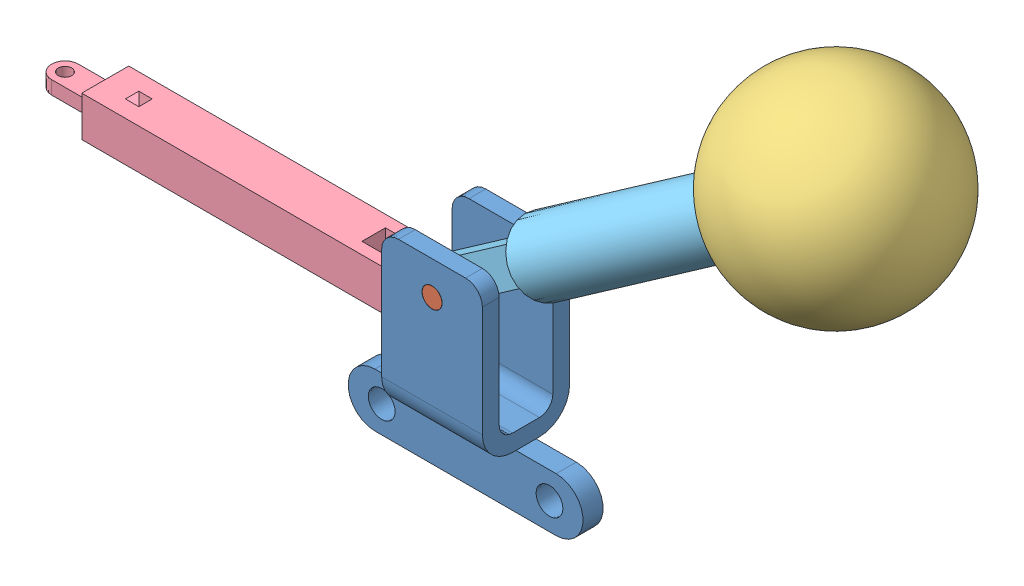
SolidWorks assembly Assem1.SLDASM, configuration Default (file format 9000). Lengths in mm.
Overall size (282.6 180.1 84.85).
6 component instances, 6 part files, 13 mates.
Components (placement in the parent):
- Box_Pivot-2: Box_Pivot.SLDPRT [Default] at origin size (70 63 26)
- Big Post-1: Big Post.SLDPRT [Default] at (0 14.56 -13) size (5.9 5.9 26)
- Handle-1: Handle.SLDPRT [Default] at (107.3089 89.6985 0) x (0.406357 -0.580337 -0.70575) z (0.404802 -0.578116 0.708461) size (60 56 60)
- Link-1: Link.SLDPRT [Default] at (-110.383 3.0885 0) x (-1 0 0) z (0 0 1) size (116 16 14)
- Post Handle-1: Post Handle.SLDPRT [Default] at (53.2449 51.8425 0) x (0.819152 0.573576 0) z (0 0 1) size (140 20 20)
- Small Post-1: Small Post.SLDPRT [Default] at (-16.383 3.0885 -7) size (5.9 5.9 14)
Mates (geometry in assembly coordinates):
- Concentric1: concentric aligned: cylinder of Post Handle-1 through (-16.383 3.0885 2.5) axis (0 0 -1) radius 3; cylinder of Small Post-1 through (-16.383 3.0885 7) axis (0 0 -1) radius 2.95
- Concentric2: concentric aligned: cylinder of Link-1 through (-16.383 3.0885 7) axis (0 0 -1) radius 3; cylinder of Small Post-1 through (-16.383 3.0885 7) axis (0 0 -1) radius 2.95
- Coincident1: coincident aligned: plane of Link-1 through (-16.383 3.0885 7) normal (0 0 1); plane of Small Post-1 through (-16.383 3.0885 7) normal (0 0 1)
- Concentric3: concentric aligned: cylinder of Big Post-1 through (0 14.56 13) axis (0 0 -1) radius 2.95; cylinder of Post Handle-1 through (0 14.56 2.5) axis (0 0 -1) radius 3
- Width2: width anti-aligned: plane of Link-1 through (-10.383 9.0885 -3.5) normal (0 0 1); plane of Link-1 through (-30.383 9.0885 3.5) normal (0 0 -1); plane of Post Handle-1 through (-16.383 3.0885 -2.5) normal (0 0 -1); plane of Post Handle-1 through (-16.383 3.0885 2.5) normal (0 0 1)
- Concentric5: concentric aligned: cylinder of Handle-1 through (95.8408 81.6684 0) axis (-0.819152 -0.573576 0) radius 6; cylinder of Post Handle-1 through (94.2025 80.5213 0) axis (-0.819152 -0.573576 0) radius 6
- Coincident3: coincident anti-aligned: plane of Handle-1 through (86.011 74.7855 0) normal (-0.819152 -0.573576 0); plane of Post Handle-1 through (86.011 74.7855 0) normal (0.819152 0.573576 0)
- Angle1: planar angle = 2.530727 rad anti-aligned: plane of Post Handle-1 through (-19.2509 7.1842 2.5) normal (-0.573576 0.819152 0); plane of Link-1 through (-110.383 9.0885 7) normal (0 1 0)
- Coincident7: coincident: line of Link-1 through (-2.1764 7.3653 3.5) axis (0 0 -1); plane of Post Handle-1
- Concentric6: concentric anti-aligned: cylinder of Box_Pivot-2 through (0 14.56 -13) axis (0 0 1) radius 3; cylinder of Big Post-1 through (0 14.56 13) axis (0 0 -1) radius 2.95
- Coincident8: coincident aligned: plane of Box_Pivot-2 through (15 -13.44 -13) normal (0 0 -1); plane of Big Post-1 through (0 14.56 -13) normal (0 0 -1)
- Width3: width anti-aligned: plane of Box_Pivot-2 through (15 24.56 8) normal (0 0 -1); plane of Box_Pivot-2 through (15 -13.44 -8) normal (0 0 1); plane of Link-1 through (-16.383 3.0885 7) normal (0 0 1); plane of Link-1 through (-16.383 3.0885 -7) normal (0 0 -1)
- Parallel3: parallel anti-aligned: plane of Box_Pivot-2 through (15 -17.44 4) normal (0 1 0); plane of Link-1 through (-110.383 -2.9115 7) normal (0 -1 0)
